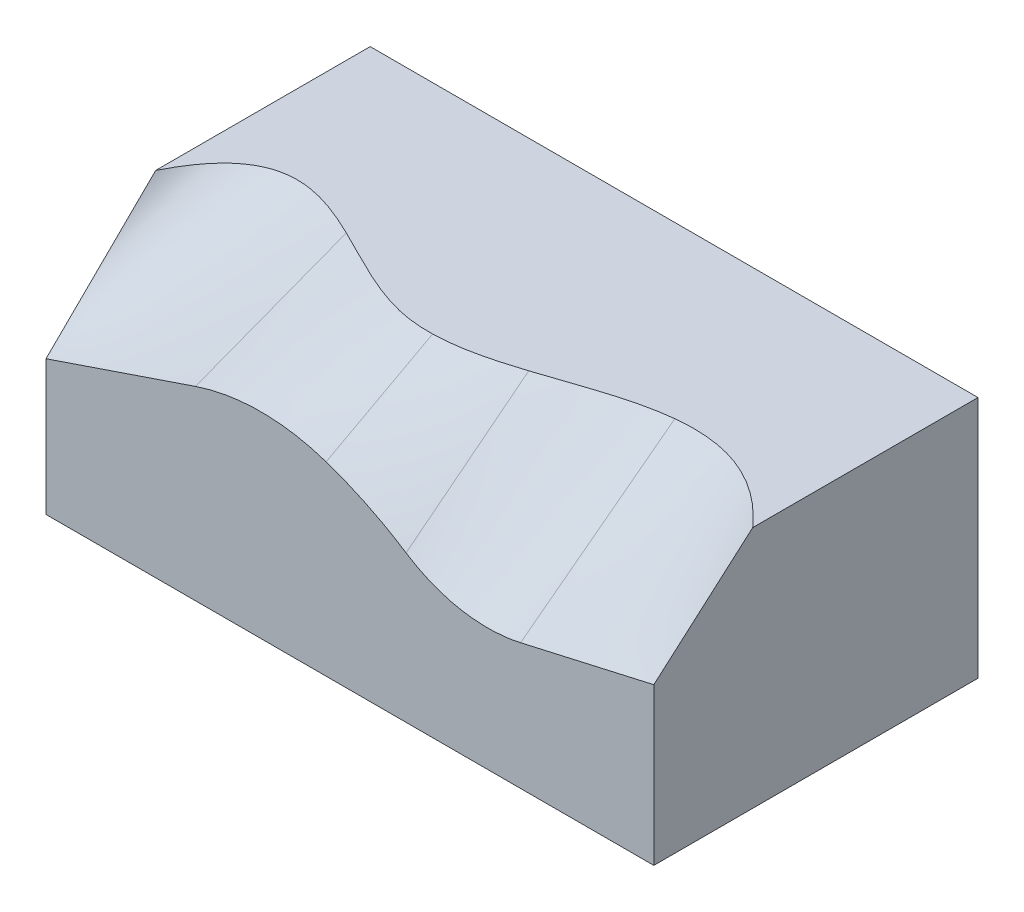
ISO-10303-21;
HEADER;
FILE_DESCRIPTION(('STEP AP214'),'2;1');
FILE_NAME('part.step','',(''),(''),'','','');
FILE_SCHEMA(('AUTOMOTIVE_DESIGN { 1 0 10303 214 1 1 1 1 }'));
ENDSEC;
DATA;
#1=APPLICATION_CONTEXT('core data for automotive mechanical design processes');
#2=APPLICATION_PROTOCOL_DEFINITION('international standard','automotive_design',2000,#1);
#3=PRODUCT_CONTEXT('',#1,'mechanical');
#4=PRODUCT('Part','Part','',(#3));
#5=PRODUCT_RELATED_PRODUCT_CATEGORY('part','',(#4));
#6=PRODUCT_DEFINITION_FORMATION('','',#4);
#7=PRODUCT_DEFINITION_CONTEXT('part definition',#1,'design');
#8=PRODUCT_DEFINITION('design','',#6,#7);
#9=PRODUCT_DEFINITION_SHAPE('','',#8);
#10=(LENGTH_UNIT() NAMED_UNIT(*) SI_UNIT(.MILLI.,.METRE.));
#11=(NAMED_UNIT(*) PLANE_ANGLE_UNIT() SI_UNIT($,.RADIAN.));
#12=(NAMED_UNIT(*) SI_UNIT($,.STERADIAN.) SOLID_ANGLE_UNIT());
#13=UNCERTAINTY_MEASURE_WITH_UNIT(LENGTH_MEASURE(1.E-05),#10,'distance_accuracy_value','');
#14=(GEOMETRIC_REPRESENTATION_CONTEXT(3) GLOBAL_UNCERTAINTY_ASSIGNED_CONTEXT((#13)) GLOBAL_UNIT_ASSIGNED_CONTEXT((#10,
#11,#12)) REPRESENTATION_CONTEXT('',''));
#15=CARTESIAN_POINT('',(0.,0.,0.));
#16=DIRECTION('',(0.,0.,1.));
#17=DIRECTION('',(1.,0.,0.));
#18=AXIS2_PLACEMENT_3D('',#15,#16,#17);
#19=CARTESIAN_POINT('',(-19.0602464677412,30.,1.3836037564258));
#20=CARTESIAN_POINT('',(-16.4696594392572,30.,2.64271465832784));
#21=CARTESIAN_POINT('',(-13.7329373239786,30.,4.15108141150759));
#22=CARTESIAN_POINT('',(-9.62797534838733,30.,5.80249540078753));
#23=CARTESIAN_POINT('',(-8.25967105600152,30.,6.25008801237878));
#24=CARTESIAN_POINT('',(-5.55963746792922,30.,6.80012059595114));
#25=CARTESIAN_POINT('',(-4.22793474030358,30.,6.89509799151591));
#26=CARTESIAN_POINT('',(-2.93234560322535,30.,6.86566078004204));
#27=CARTESIAN_POINT('',(-19.0602464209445,22.9093358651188,20.));
#28=CARTESIAN_POINT('',(-16.468830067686,23.789720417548,20.));
#29=CARTESIAN_POINT('',(-13.7329373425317,24.241727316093,20.));
#30=CARTESIAN_POINT('',(-9.62797534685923,24.241727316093,20.));
#31=CARTESIAN_POINT('',(-8.25967105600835,24.1294472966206,20.));
#32=CARTESIAN_POINT('',(-5.55963746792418,23.6833257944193,20.));
#33=CARTESIAN_POINT('',(-4.22794759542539,23.3494920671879,20.));
#34=CARTESIAN_POINT('',(-2.93234560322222,22.9093358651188,20.));
#35=B_SPLINE_SURFACE_WITH_KNOTS('',1,3,((#19,#20,#21,#22,#23,#24,#25,#26),(#27,#28,#29,#30,#31,
#32,#33,#34)),.UNSPECIFIED.,.F.,.F.,.F.,(2,2),(4,2,2,4),(0.,1.),(1.24329893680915,
1.5707963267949,1.73454502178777,1.89829371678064),.UNSPECIFIED.);
#36=CARTESIAN_POINT('',(-19.0602464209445,22.9093358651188,20.));
#37=CARTESIAN_POINT('',(-19.0602464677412,30.,1.3836037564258));
#38=B_SPLINE_CURVE_WITH_KNOTS('',1,(#36,#37),.UNSPECIFIED.,.F.,.F.,(2,2),(0.,1.),.UNSPECIFIED.);
#39=CARTESIAN_POINT('',(-19.0602464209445,22.9093358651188,20.));
#40=VERTEX_POINT('',#39);
#41=CARTESIAN_POINT('',(-19.0602464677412,30.,1.3836037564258));
#42=VERTEX_POINT('',#41);
#43=EDGE_CURVE('E11',#40,#42,#38,.T.);
#44=CARTESIAN_POINT('',(-19.0602464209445,22.9093358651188,20.));
#45=CARTESIAN_POINT('',(-16.468830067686,23.789720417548,20.));
#46=CARTESIAN_POINT('',(-13.7329373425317,24.241727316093,20.));
#47=CARTESIAN_POINT('',(-9.62797534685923,24.241727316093,20.));
#48=CARTESIAN_POINT('',(-8.25967105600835,24.1294472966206,20.));
#49=CARTESIAN_POINT('',(-5.55963746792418,23.6833257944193,20.));
#50=CARTESIAN_POINT('',(-4.22794759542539,23.3494920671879,20.));
#51=CARTESIAN_POINT('',(-2.93234560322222,22.9093358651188,20.));
#52=B_SPLINE_CURVE_WITH_KNOTS('',3,(#44,#45,#46,#47,#48,#49,#50,#51),.UNSPECIFIED.,.F.,.F.,(4,2,
2,4),(1.24329893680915,1.5707963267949,1.73454502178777,1.89829371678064),.UNSPECIFIED.);
#53=CARTESIAN_POINT('',(-2.93234560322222,22.9093358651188,20.));
#54=VERTEX_POINT('',#53);
#55=EDGE_CURVE('E124',#40,#54,#52,.T.);
#56=CARTESIAN_POINT('',(-2.93234560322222,22.9093358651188,20.));
#57=CARTESIAN_POINT('',(-2.93234560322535,30.,6.86566078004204));
#58=B_SPLINE_CURVE_WITH_KNOTS('',1,(#56,#57),.UNSPECIFIED.,.F.,.F.,(2,2),(0.,1.),.UNSPECIFIED.);
#59=CARTESIAN_POINT('',(-2.93234560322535,30.,6.86566078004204));
#60=VERTEX_POINT('',#59);
#61=EDGE_CURVE('E48',#54,#60,#58,.T.);
#62=CARTESIAN_POINT('',(-2.93234560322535,30.,6.86566078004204));
#63=CARTESIAN_POINT('',(-4.22793474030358,30.,6.89509799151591));
#64=CARTESIAN_POINT('',(-5.55963746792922,30.,6.80012059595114));
#65=CARTESIAN_POINT('',(-8.25967105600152,30.,6.25008801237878));
#66=CARTESIAN_POINT('',(-9.62797534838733,30.,5.80249540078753));
#67=CARTESIAN_POINT('',(-13.7329373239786,30.,4.15108141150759));
#68=CARTESIAN_POINT('',(-16.4696594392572,30.,2.64271465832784));
#69=CARTESIAN_POINT('',(-19.0602464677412,30.,1.3836037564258));
#70=B_SPLINE_CURVE_WITH_KNOTS('',3,(#62,#63,#64,#65,#66,#67,#68,#69),.UNSPECIFIED.,.F.,.F.,(4,2,
2,4),(1.24329893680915,1.40704763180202,1.5707963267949,1.89829371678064),.UNSPECIFIED.);
#71=EDGE_CURVE('E120',#42,#60,#70,.F.);
#72=ORIENTED_EDGE('',*,*,#43,.F.);
#73=ORIENTED_EDGE('',*,*,#55,.T.);
#74=ORIENTED_EDGE('',*,*,#61,.T.);
#75=ORIENTED_EDGE('',*,*,#71,.F.);
#76=EDGE_LOOP('',(#72,#73,#74,#75));
#77=FACE_BOUND('',#76,.T.);
#78=ADVANCED_FACE('F34',(#77),#35,.T.);
#79=CARTESIAN_POINT('',(-2.93234560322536,30.,6.86566078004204));
#80=CARTESIAN_POINT('',(-1.19683927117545,30.,6.82622816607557));
#81=CARTESIAN_POINT('',(0.501611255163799,30.,6.5664786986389));
#82=CARTESIAN_POINT('',(3.79800894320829,30.,5.83137113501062));
#83=CARTESIAN_POINT('',(5.39617921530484,30.,5.35647146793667));
#84=CARTESIAN_POINT('',(6.93099869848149,30.,4.86386269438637));
#85=CARTESIAN_POINT('',(-2.93234560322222,22.9093358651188,20.));
#86=CARTESIAN_POINT('',(-1.1968699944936,22.3197409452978,20.));
#87=CARTESIAN_POINT('',(0.501611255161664,21.6212977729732,20.));
#88=CARTESIAN_POINT('',(3.79800894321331,20.0176448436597,20.));
#89=CARTESIAN_POINT('',(5.39590570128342,19.1124446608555,20.));
#90=CARTESIAN_POINT('',(6.93099869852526,18.1109521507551,20.));
#91=B_SPLINE_SURFACE_WITH_KNOTS('',1,3,((#79,#80,#81,#82,#83,#84),(#85,#86,#87,#88,#89,#90)),
.UNSPECIFIED.,.F.,.F.,.F.,(2,2),(4,2,4),(0.,1.),(1.89829371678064,2.02357479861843,
2.14885588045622),.UNSPECIFIED.);
#92=CARTESIAN_POINT('',(-2.93234560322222,22.9093358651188,20.));
#93=CARTESIAN_POINT('',(-1.1968699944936,22.3197409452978,20.));
#94=CARTESIAN_POINT('',(0.501611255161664,21.6212977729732,20.));
#95=CARTESIAN_POINT('',(3.79800894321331,20.0176448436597,20.));
#96=CARTESIAN_POINT('',(5.39590570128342,19.1124446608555,20.));
#97=CARTESIAN_POINT('',(6.93099869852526,18.1109521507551,20.));
#98=B_SPLINE_CURVE_WITH_KNOTS('',3,(#92,#93,#94,#95,#96,#97),.UNSPECIFIED.,.F.,.F.,(4,2,4),
(1.89829371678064,2.02357479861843,2.14885588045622),.UNSPECIFIED.);
#99=CARTESIAN_POINT('',(6.93099869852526,18.1109521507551,20.));
#100=VERTEX_POINT('',#99);
#101=EDGE_CURVE('E445',#54,#100,#98,.T.);
#102=CARTESIAN_POINT('',(6.93099869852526,18.1109521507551,20.));
#103=CARTESIAN_POINT('',(6.93099869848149,30.,4.86386269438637));
#104=B_SPLINE_CURVE_WITH_KNOTS('',1,(#102,#103),.UNSPECIFIED.,.F.,.F.,(2,2),(0.,1.),.UNSPECIFIED.);
#105=CARTESIAN_POINT('',(6.93099869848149,30.,4.86386269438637));
#106=VERTEX_POINT('',#105);
#107=EDGE_CURVE('E130',#100,#106,#104,.T.);
#108=CARTESIAN_POINT('',(6.93099869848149,30.,4.86386269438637));
#109=CARTESIAN_POINT('',(5.39617921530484,30.,5.35647146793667));
#110=CARTESIAN_POINT('',(3.79800894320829,30.,5.83137113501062));
#111=CARTESIAN_POINT('',(0.501611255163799,30.,6.5664786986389));
#112=CARTESIAN_POINT('',(-1.19683927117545,30.,6.82622816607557));
#113=CARTESIAN_POINT('',(-2.93234560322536,30.,6.86566078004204));
#114=B_SPLINE_CURVE_WITH_KNOTS('',3,(#108,#109,#110,#111,#112,#113),.UNSPECIFIED.,.F.,.F.,(4,2,
4),(1.89829371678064,2.02357479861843,2.14885588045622),.UNSPECIFIED.);
#115=EDGE_CURVE('E134',#60,#106,#114,.F.);
#116=ORIENTED_EDGE('',*,*,#61,.F.);
#117=ORIENTED_EDGE('',*,*,#101,.T.);
#118=ORIENTED_EDGE('',*,*,#107,.T.);
#119=ORIENTED_EDGE('',*,*,#115,.F.);
#120=EDGE_LOOP('',(#116,#117,#118,#119));
#121=FACE_BOUND('',#120,.T.);
#122=ADVANCED_FACE('F136',(#121),#91,.T.);
#123=CARTESIAN_POINT('',(21.059572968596,15.5784718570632,20.));
#124=CARTESIAN_POINT('',(19.8613116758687,15.3063170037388,20.));
#125=CARTESIAN_POINT('',(18.6357585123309,15.1546097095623,20.));
#126=CARTESIAN_POINT('',(16.1788795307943,15.098123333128,20.));
#127=CARTESIAN_POINT('',(14.9476342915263,15.1933491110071,20.));
#128=CARTESIAN_POINT('',(12.5286583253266,15.6269391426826,20.));
#129=CARTESIAN_POINT('',(11.3409924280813,15.9652917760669,20.));
#130=CARTESIAN_POINT('',(9.05669202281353,16.8716121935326,20.));
#131=CARTESIAN_POINT('',(7.96013138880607,17.4395474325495,20.));
#132=CARTESIAN_POINT('',(6.93099869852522,18.1109521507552,20.));
#133=CARTESIAN_POINT('',(21.0595729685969,30.,0.966564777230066));
#134=CARTESIAN_POINT('',(19.8614006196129,30.,1.09239312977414));
#135=CARTESIAN_POINT('',(18.6357585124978,30.,1.31314282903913));
#136=CARTESIAN_POINT('',(16.1788795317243,30.,1.88604165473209));
#137=CARTESIAN_POINT('',(14.9476342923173,30.,2.23737287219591));
#138=CARTESIAN_POINT('',(12.5286583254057,30.,2.98979415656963));
#139=CARTESIAN_POINT('',(11.3409924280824,30.,3.39007647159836));
#140=CARTESIAN_POINT('',(9.05669202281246,30.,4.16222626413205));
#141=CARTESIAN_POINT('',(7.95991199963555,30.,4.53362729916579));
#142=CARTESIAN_POINT('',(6.93099869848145,30.,4.86386269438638));
#143=B_SPLINE_SURFACE_WITH_KNOTS('',1,3,((#123,#124,#125,#126,#127,#128,#129,#130,#131,#132),
(#133,#134,#135,#136,#137,#138,#139,#140,#141,#142)),.UNSPECIFIED.,.F.,.F.,.F.,(2,2),(4,2,2,2,
4),(0.,1.),(4.48905304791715,4.68940191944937,4.88975079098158,5.0900996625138,
5.29044853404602),.UNSPECIFIED.);
#144=CARTESIAN_POINT('',(6.93099869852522,18.1109521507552,20.));
#145=CARTESIAN_POINT('',(7.96013138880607,17.4395474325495,20.));
#146=CARTESIAN_POINT('',(9.05669202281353,16.8716121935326,20.));
#147=CARTESIAN_POINT('',(11.3409924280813,15.9652917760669,20.));
#148=CARTESIAN_POINT('',(12.5286583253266,15.6269391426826,20.));
#149=CARTESIAN_POINT('',(14.9476342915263,15.1933491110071,20.));
#150=CARTESIAN_POINT('',(16.1788795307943,15.098123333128,20.));
#151=CARTESIAN_POINT('',(18.6357585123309,15.1546097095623,20.));
#152=CARTESIAN_POINT('',(19.8613116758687,15.3063170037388,20.));
#153=CARTESIAN_POINT('',(21.059572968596,15.5784718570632,20.));
#154=B_SPLINE_CURVE_WITH_KNOTS('',3,(#144,#145,#146,#147,#148,#149,#150,#151,#152,#153),
.UNSPECIFIED.,.F.,.F.,(4,2,2,2,4),(4.48905304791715,4.68940191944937,4.88975079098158,
5.0900996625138,5.29044853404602),.UNSPECIFIED.);
#155=CARTESIAN_POINT('',(21.059572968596,15.5784718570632,20.));
#156=VERTEX_POINT('',#155);
#157=EDGE_CURVE('E441',#100,#156,#154,.T.);
#158=CARTESIAN_POINT('',(21.059572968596,15.5784718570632,20.));
#159=CARTESIAN_POINT('',(21.0595729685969,30.,0.966564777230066));
#160=B_SPLINE_CURVE_WITH_KNOTS('',1,(#158,#159),.UNSPECIFIED.,.F.,.F.,(2,2),(0.,1.),.UNSPECIFIED.);
#161=CARTESIAN_POINT('',(21.0595729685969,30.,0.966564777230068));
#162=VERTEX_POINT('',#161);
#163=EDGE_CURVE('E56',#156,#162,#160,.T.);
#164=CARTESIAN_POINT('',(21.0595729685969,30.,0.966564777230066));
#165=CARTESIAN_POINT('',(19.8614006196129,30.,1.09239312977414));
#166=CARTESIAN_POINT('',(18.6357585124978,30.,1.31314282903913));
#167=CARTESIAN_POINT('',(16.1788795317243,30.,1.88604165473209));
#168=CARTESIAN_POINT('',(14.9476342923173,30.,2.23737287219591));
#169=CARTESIAN_POINT('',(12.5286583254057,30.,2.98979415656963));
#170=CARTESIAN_POINT('',(11.3409924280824,30.,3.39007647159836));
#171=CARTESIAN_POINT('',(9.05669202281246,30.,4.16222626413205));
#172=CARTESIAN_POINT('',(7.95991199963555,30.,4.53362729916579));
#173=CARTESIAN_POINT('',(6.93099869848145,30.,4.86386269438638));
#174=B_SPLINE_CURVE_WITH_KNOTS('',3,(#164,#165,#166,#167,#168,#169,#170,#171,#172,#173),
.UNSPECIFIED.,.F.,.F.,(4,2,2,2,4),(4.48905304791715,4.68940191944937,4.88975079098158,
5.0900996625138,5.29044853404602),.UNSPECIFIED.);
#175=EDGE_CURVE('E141',#106,#162,#174,.F.);
#176=ORIENTED_EDGE('',*,*,#107,.F.);
#177=ORIENTED_EDGE('',*,*,#157,.T.);
#178=ORIENTED_EDGE('',*,*,#163,.T.);
#179=ORIENTED_EDGE('',*,*,#175,.F.);
#180=EDGE_LOOP('',(#176,#177,#178,#179));
#181=FACE_BOUND('',#180,.T.);
#182=ADVANCED_FACE('F252',(#181),#143,.T.);
#183=CARTESIAN_POINT('',(21.0595729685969,30.,0.966564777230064));
#184=CARTESIAN_POINT('',(24.0735901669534,30.,0.650042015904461));
#185=CARTESIAN_POINT('',(27.0877297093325,30.,0.904988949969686));
#186=CARTESIAN_POINT('',(31.608846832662,30.,2.86271309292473));
#187=CARTESIAN_POINT('',(33.1158860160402,30.,3.77810861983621));
#188=CARTESIAN_POINT('',(35.3764448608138,30.,5.6385165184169));
#189=CARTESIAN_POINT('',(36.1299488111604,30.,6.33988320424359));
#190=CARTESIAN_POINT('',(37.0718644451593,30.,7.32811704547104));
#191=CARTESIAN_POINT('',(37.2602437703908,30.,7.53133503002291));
#192=CARTESIAN_POINT('',(37.6370035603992,30.,7.94917328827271));
#193=CARTESIAN_POINT('',(37.8253834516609,30.,8.16002592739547));
#194=CARTESIAN_POINT('',(38.3905231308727,30.,8.78989587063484));
#195=CARTESIAN_POINT('',(38.7672829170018,30.,9.20980916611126));
#196=CARTESIAN_POINT('',(39.1440427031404,30.,9.6297224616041));
#197=CARTESIAN_POINT('',(21.059572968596,15.5784718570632,20.));
#198=CARTESIAN_POINT('',(24.0736512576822,16.2630437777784,20.));
#199=CARTESIAN_POINT('',(27.0877295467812,16.9476156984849,20.));
#200=CARTESIAN_POINT('',(31.6088469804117,17.9744735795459,20.));
#201=CARTESIAN_POINT('',(33.1158861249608,18.3167595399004,20.));
#202=CARTESIAN_POINT('',(35.376444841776,18.8301884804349,20.));
#203=CARTESIAN_POINT('',(36.1299644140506,19.0013314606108,20.));
#204=CARTESIAN_POINT('',(37.0718638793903,19.2152601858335,20.));
#205=CARTESIAN_POINT('',(37.260243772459,19.2580459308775,20.));
#206=CARTESIAN_POINT('',(37.6370035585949,19.3436174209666,20.));
#207=CARTESIAN_POINT('',(37.8253834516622,19.3864031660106,20.));
#208=CARTESIAN_POINT('',(38.39052313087,19.5147604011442,20.));
#209=CARTESIAN_POINT('',(38.7672829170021,19.6003318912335,20.));
#210=CARTESIAN_POINT('',(39.1440427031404,19.6859033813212,20.));
#211=B_SPLINE_SURFACE_WITH_KNOTS('',1,3,((#183,#184,#185,#186,#187,#188,#189,#190,#191,#192,
#193,#194,#195,#196),(#197,#198,#199,#200,#201,#202,#203,#204,#205,#206,#207,#208,#209,#210)),
.UNSPECIFIED.,.F.,.F.,.F.,(2,2),(4,2,2,2,2,2,4),(0.,1.),(0.0539110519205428,0.063183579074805,
0.0678198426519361,0.0701379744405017,0.0707175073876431,0.0712970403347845,0.0724561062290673),.UNSPECIFIED.);
#212=CARTESIAN_POINT('',(21.059572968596,15.5784718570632,20.));
#213=CARTESIAN_POINT('',(24.0736512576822,16.2630437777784,20.));
#214=CARTESIAN_POINT('',(27.0877295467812,16.9476156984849,20.));
#215=CARTESIAN_POINT('',(31.6088469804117,17.9744735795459,20.));
#216=CARTESIAN_POINT('',(33.1158861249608,18.3167595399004,20.));
#217=CARTESIAN_POINT('',(35.376444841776,18.8301884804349,20.));
#218=CARTESIAN_POINT('',(36.1299644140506,19.0013314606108,20.));
#219=CARTESIAN_POINT('',(37.0718638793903,19.2152601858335,20.));
#220=CARTESIAN_POINT('',(37.260243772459,19.2580459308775,20.));
#221=CARTESIAN_POINT('',(37.6370035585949,19.3436174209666,20.));
#222=CARTESIAN_POINT('',(37.8253834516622,19.3864031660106,20.));
#223=CARTESIAN_POINT('',(38.39052313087,19.5147604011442,20.));
#224=CARTESIAN_POINT('',(38.7672829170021,19.6003318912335,20.));
#225=CARTESIAN_POINT('',(39.1440427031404,19.6859033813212,20.));
#226=B_SPLINE_CURVE_WITH_KNOTS('',3,(#212,#213,#214,#215,#216,#217,#218,#219,#220,#221,#222,
#223,#224,#225),.UNSPECIFIED.,.F.,.F.,(4,2,2,2,2,2,4),(0.0539110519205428,0.063183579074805,
0.0678198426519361,0.0701379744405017,0.0707175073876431,0.0712970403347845,0.0724561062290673),.UNSPECIFIED.);
#227=CARTESIAN_POINT('',(37.5,19.3125005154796,20.));
#228=VERTEX_POINT('',#227);
#229=EDGE_CURVE('E235',#156,#228,#226,.T.);
#230=CARTESIAN_POINT('',(37.5,19.3125005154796,20.));
#231=CARTESIAN_POINT('',(37.5,19.7578110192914,19.4915555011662));
#232=CARTESIAN_POINT('',(37.5,20.2031215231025,18.9831110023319));
#233=CARTESIAN_POINT('',(37.5,21.0937425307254,17.9662220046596));
#234=CARTESIAN_POINT('',(37.5,21.5390530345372,17.4577775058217));
#235=CARTESIAN_POINT('',(37.5,22.4296740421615,16.4408885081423));
#236=CARTESIAN_POINT('',(37.5,22.874984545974,15.9324440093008));
#237=CARTESIAN_POINT('',(37.5,23.7656055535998,14.9155550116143));
#238=CARTESIAN_POINT('',(37.5,24.2109160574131,14.4071105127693));
#239=CARTESIAN_POINT('',(37.5,25.1015370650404,13.3902215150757));
#240=CARTESIAN_POINT('',(37.5,25.5468475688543,12.8817770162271));
#241=CARTESIAN_POINT('',(37.5,26.4374685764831,11.8648880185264));
#242=CARTESIAN_POINT('',(37.5,26.8827790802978,11.3564435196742));
#243=CARTESIAN_POINT('',(37.5,27.7734000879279,10.3395545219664));
#244=CARTESIAN_POINT('',(37.5,28.2187105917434,9.83111002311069));
#245=CARTESIAN_POINT('',(37.5,29.109331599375,8.81422102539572));
#246=CARTESIAN_POINT('',(37.5,29.5546421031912,8.30577652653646));
#247=CARTESIAN_POINT('',(37.5,29.9999526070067,7.79733202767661));
#248=B_SPLINE_CURVE_WITH_KNOTS('',3,(#230,#231,#232,#233,#234,#235,#236,#237,#238,#239,#240,
#241,#242,#243,#244,#245,#246,#247),.UNSPECIFIED.,.F.,.F.,(4,2,2,2,2,2,2,2,4),(0.,
2.02764772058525,4.05529544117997,6.08294316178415,8.1105908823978,10.1382386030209,
12.1658863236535,14.1935340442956,16.2211817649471),.UNSPECIFIED.);
#249=CARTESIAN_POINT('',(37.5,29.9999526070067,7.79733202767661));
#250=VERTEX_POINT('',#249);
#251=EDGE_CURVE('E69',#250,#228,#248,.F.);
#252=CARTESIAN_POINT('',(39.1440427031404,30.,9.6297224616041));
#253=CARTESIAN_POINT('',(38.7672829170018,30.,9.20980916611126));
#254=CARTESIAN_POINT('',(38.3905231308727,30.,8.78989587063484));
#255=CARTESIAN_POINT('',(37.8253834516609,30.,8.16002592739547));
#256=CARTESIAN_POINT('',(37.6370035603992,30.,7.94917328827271));
#257=CARTESIAN_POINT('',(37.2602437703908,30.,7.53133503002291));
#258=CARTESIAN_POINT('',(37.0718644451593,30.,7.32811704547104));
#259=CARTESIAN_POINT('',(36.1299488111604,30.,6.33988320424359));
#260=CARTESIAN_POINT('',(35.3764448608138,30.,5.6385165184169));
#261=CARTESIAN_POINT('',(33.1158860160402,30.,3.77810861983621));
#262=CARTESIAN_POINT('',(31.608846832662,30.,2.86271309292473));
#263=CARTESIAN_POINT('',(27.0877297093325,30.,0.904988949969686));
#264=CARTESIAN_POINT('',(24.0735901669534,30.,0.650042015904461));
#265=CARTESIAN_POINT('',(21.0595729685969,30.,0.966564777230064));
#266=B_SPLINE_CURVE_WITH_KNOTS('',3,(#252,#253,#254,#255,#256,#257,#258,#259,#260,#261,#262,
#263,#264,#265),.UNSPECIFIED.,.F.,.F.,(4,2,2,2,2,2,4),(0.0539110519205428,0.0550701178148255,
0.0556496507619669,0.0562291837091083,0.0585473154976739,0.063183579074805,0.0724561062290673),.UNSPECIFIED.);
#267=EDGE_CURVE('E279',#162,#250,#266,.F.);
#268=ORIENTED_EDGE('',*,*,#163,.F.);
#269=ORIENTED_EDGE('',*,*,#229,.T.);
#270=ORIENTED_EDGE('',*,*,#251,.F.);
#271=ORIENTED_EDGE('',*,*,#267,.F.);
#272=EDGE_LOOP('',(#268,#269,#270,#271));
#273=FACE_BOUND('',#272,.T.);
#274=ADVANCED_FACE('F241',(#273),#211,.T.);
#275=CARTESIAN_POINT('',(-39.3439753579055,30.,10.1358317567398));
#276=CARTESIAN_POINT('',(-38.9213976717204,30.,9.29448241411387));
#277=CARTESIAN_POINT('',(-38.4988199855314,30.,8.4531330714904));
#278=CARTESIAN_POINT('',(-37.970597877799,30.,7.40144639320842));
#279=CARTESIAN_POINT('',(-37.8649534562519,30.,7.19110905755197));
#280=CARTESIAN_POINT('',(-37.653664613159,30.,6.77043438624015));
#281=CARTESIAN_POINT('',(-37.5480202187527,30.,6.5584969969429));
#282=CARTESIAN_POINT('',(-37.231086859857,30.,5.93408866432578));
#283=CARTESIAN_POINT('',(-37.0197980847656,30.,5.54190994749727));
#284=CARTESIAN_POINT('',(-35.963353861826,30.,3.69115267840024));
#285=CARTESIAN_POINT('',(-35.1181984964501,30.,2.5595499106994));
#286=CARTESIAN_POINT('',(-33.4278877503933,30.,0.79320988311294));
#287=CARTESIAN_POINT('',(-32.5827323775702,30.,0.15969015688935));
#288=CARTESIAN_POINT('',(-30.8924216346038,30.,-0.744921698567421));
#289=CARTESIAN_POINT('',(-30.0472651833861,30.,-1.0153926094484));
#290=CARTESIAN_POINT('',(-28.356956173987,30.,-1.2919127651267));
#291=CARTESIAN_POINT('',(-27.5118131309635,30.,-1.29761665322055));
#292=CARTESIAN_POINT('',(-25.8214779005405,30.,-1.11968353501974));
#293=CARTESIAN_POINT('',(-24.9763345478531,30.,-0.935843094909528));
#294=CARTESIAN_POINT('',(-22.4408696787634,30.,-0.190408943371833));
#295=CARTESIAN_POINT('',(-20.7498777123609,30.,0.562387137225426));
#296=CARTESIAN_POINT('',(-19.0602464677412,30.,1.3836037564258));
#297=CARTESIAN_POINT('',(-39.3439753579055,16.0183236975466,20.));
#298=CARTESIAN_POINT('',(-38.9213976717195,16.1618864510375,20.));
#299=CARTESIAN_POINT('',(-38.4988199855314,16.305449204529,20.));
#300=CARTESIAN_POINT('',(-37.970597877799,16.4849026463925,20.));
#301=CARTESIAN_POINT('',(-37.8649534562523,16.5207933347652,20.));
#302=CARTESIAN_POINT('',(-37.6536646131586,16.592574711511,20.));
#303=CARTESIAN_POINT('',(-37.5480201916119,16.6284653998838,20.));
#304=CARTESIAN_POINT('',(-37.2310869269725,16.7361374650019,20.));
#305=CARTESIAN_POINT('',(-37.0197980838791,16.8079188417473,20.));
#306=CARTESIAN_POINT('',(-35.9633538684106,17.1668257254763,20.));
#307=CARTESIAN_POINT('',(-35.1181984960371,17.4539512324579,20.));
#308=CARTESIAN_POINT('',(-33.4278877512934,18.0282022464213,20.));
#309=CARTESIAN_POINT('',(-32.5827323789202,18.3153277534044,20.));
#310=CARTESIAN_POINT('',(-30.8924216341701,18.8895787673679,20.));
#311=CARTESIAN_POINT('',(-30.0472662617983,19.176704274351,20.));
#312=CARTESIAN_POINT('',(-28.3569555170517,19.7509552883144,20.));
#313=CARTESIAN_POINT('',(-27.5118001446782,20.038080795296,20.));
#314=CARTESIAN_POINT('',(-25.8214893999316,20.6123318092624,20.));
#315=CARTESIAN_POINT('',(-24.9763340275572,20.8994573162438,20.));
#316=CARTESIAN_POINT('',(-22.4408679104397,21.7608338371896,20.));
#317=CARTESIAN_POINT('',(-20.7505571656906,22.3350848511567,20.));
#318=CARTESIAN_POINT('',(-19.0602464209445,22.9093358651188,20.));
#319=B_SPLINE_SURFACE_WITH_KNOTS('',1,3,((#275,#276,#277,#278,#279,#280,#281,#282,#283,#284,
#285,#286,#287,#288,#289,#290,#291,#292,#293,#294,#295,#296),(#297,#298,#299,#300,#301,#302,
#303,#304,#305,#306,#307,#308,#309,#310,#311,#312,#313,#314,#315,#316,#317,#318)),.UNSPECIFIED.,
.F.,.F.,.F.,(2,2),(4,2,2,2,2,2,2,2,2,2,4),(0.,1.),(-0.00624351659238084,-0.0049046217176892,
-0.00456989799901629,-0.00423517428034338,-0.00356572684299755,-0.000887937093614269,
0.00178985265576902,0.0044676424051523,0.00714543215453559,0.00982322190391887,
0.0151788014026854),.UNSPECIFIED.);
#320=CARTESIAN_POINT('',(-39.3439753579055,16.0183236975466,20.));
#321=CARTESIAN_POINT('',(-38.9213976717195,16.1618864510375,20.));
#322=CARTESIAN_POINT('',(-38.4988199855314,16.305449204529,20.));
#323=CARTESIAN_POINT('',(-37.970597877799,16.4849026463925,20.));
#324=CARTESIAN_POINT('',(-37.8649534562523,16.5207933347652,20.));
#325=CARTESIAN_POINT('',(-37.6536646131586,16.592574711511,20.));
#326=CARTESIAN_POINT('',(-37.5480201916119,16.6284653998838,20.));
#327=CARTESIAN_POINT('',(-37.2310869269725,16.7361374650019,20.));
#328=CARTESIAN_POINT('',(-37.0197980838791,16.8079188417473,20.));
#329=CARTESIAN_POINT('',(-35.9633538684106,17.1668257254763,20.));
#330=CARTESIAN_POINT('',(-35.1181984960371,17.4539512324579,20.));
#331=CARTESIAN_POINT('',(-33.4278877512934,18.0282022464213,20.));
#332=CARTESIAN_POINT('',(-32.5827323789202,18.3153277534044,20.));
#333=CARTESIAN_POINT('',(-30.8924216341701,18.8895787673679,20.));
#334=CARTESIAN_POINT('',(-30.0472662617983,19.176704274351,20.));
#335=CARTESIAN_POINT('',(-28.3569555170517,19.7509552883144,20.));
#336=CARTESIAN_POINT('',(-27.5118001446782,20.038080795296,20.));
#337=CARTESIAN_POINT('',(-25.8214893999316,20.6123318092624,20.));
#338=CARTESIAN_POINT('',(-24.9763340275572,20.8994573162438,20.));
#339=CARTESIAN_POINT('',(-22.4408679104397,21.7608338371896,20.));
#340=CARTESIAN_POINT('',(-20.7505571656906,22.3350848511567,20.));
#341=CARTESIAN_POINT('',(-19.0602464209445,22.9093358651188,20.));
#342=B_SPLINE_CURVE_WITH_KNOTS('',3,(#320,#321,#322,#323,#324,#325,#326,#327,#328,#329,#330,
#331,#332,#333,#334,#335,#336,#337,#338,#339,#340,#341),.UNSPECIFIED.,.F.,.F.,(4,2,2,2,2,2,2,2,
2,2,4),(-0.00624351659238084,-0.0049046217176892,-0.00456989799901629,-0.00423517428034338,
-0.00356572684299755,-0.000887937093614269,0.00178985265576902,0.0044676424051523,
0.00714543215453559,0.00982322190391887,0.0151788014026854),.UNSPECIFIED.);
#343=CARTESIAN_POINT('',(-37.5,16.644779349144,20.));
#344=VERTEX_POINT('',#343);
#345=EDGE_CURVE('E354',#344,#40,#342,.T.);
#346=CARTESIAN_POINT('',(-19.0602464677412,30.,1.3836037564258));
#347=CARTESIAN_POINT('',(-20.7498777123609,30.,0.562387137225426));
#348=CARTESIAN_POINT('',(-22.4408696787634,30.,-0.190408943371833));
#349=CARTESIAN_POINT('',(-24.9763345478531,30.,-0.935843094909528));
#350=CARTESIAN_POINT('',(-25.8214779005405,30.,-1.11968353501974));
#351=CARTESIAN_POINT('',(-27.5118131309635,30.,-1.29761665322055));
#352=CARTESIAN_POINT('',(-28.356956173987,30.,-1.2919127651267));
#353=CARTESIAN_POINT('',(-30.0472651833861,30.,-1.0153926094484));
#354=CARTESIAN_POINT('',(-30.8924216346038,30.,-0.744921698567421));
#355=CARTESIAN_POINT('',(-32.5827323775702,30.,0.15969015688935));
#356=CARTESIAN_POINT('',(-33.4278877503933,30.,0.79320988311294));
#357=CARTESIAN_POINT('',(-35.1181984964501,30.,2.5595499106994));
#358=CARTESIAN_POINT('',(-35.963353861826,30.,3.69115267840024));
#359=CARTESIAN_POINT('',(-37.0197980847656,30.,5.54190994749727));
#360=CARTESIAN_POINT('',(-37.231086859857,30.,5.93408866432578));
#361=CARTESIAN_POINT('',(-37.5480202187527,30.,6.5584969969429));
#362=CARTESIAN_POINT('',(-37.653664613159,30.,6.77043438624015));
#363=CARTESIAN_POINT('',(-37.8649534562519,30.,7.19110905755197));
#364=CARTESIAN_POINT('',(-37.970597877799,30.,7.40144639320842));
#365=CARTESIAN_POINT('',(-38.4988199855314,30.,8.4531330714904));
#366=CARTESIAN_POINT('',(-38.9213976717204,30.,9.29448241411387));
#367=CARTESIAN_POINT('',(-39.3439753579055,30.,10.1358317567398));
#368=B_SPLINE_CURVE_WITH_KNOTS('',3,(#346,#347,#348,#349,#350,#351,#352,#353,#354,#355,#356,
#357,#358,#359,#360,#361,#362,#363,#364,#365,#366,#367),.UNSPECIFIED.,.F.,.F.,(4,2,2,2,2,2,2,2,
2,2,4),(-0.00624351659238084,-0.000887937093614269,0.00178985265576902,0.0044676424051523,
0.00714543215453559,0.00982322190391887,0.0125010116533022,0.013170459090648,0.0135051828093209,
0.0138399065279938,0.0151788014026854),.UNSPECIFIED.);
#369=CARTESIAN_POINT('',(-37.5,29.9998725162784,6.46436338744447));
#370=VERTEX_POINT('',#369);
#371=EDGE_CURVE('E147',#370,#42,#368,.F.);
#372=CARTESIAN_POINT('',(-37.5,29.9998725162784,6.46436338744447));
#373=CARTESIAN_POINT('',(-37.5,29.4434103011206,7.02834824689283));
#374=CARTESIAN_POINT('',(-37.5,28.8869480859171,7.59233310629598));
#375=CARTESIAN_POINT('',(-37.5,27.7740236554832,8.72030282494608));
#376=CARTESIAN_POINT('',(-37.5,27.2175614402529,9.28428768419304));
#377=CARTESIAN_POINT('',(-37.5,26.1046370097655,10.4122574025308));
#378=CARTESIAN_POINT('',(-37.5,25.5481747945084,10.9762422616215));
#379=CARTESIAN_POINT('',(-37.5,24.4352503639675,12.1042119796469));
#380=CARTESIAN_POINT('',(-37.5,23.8787881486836,12.6681968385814));
#381=CARTESIAN_POINT('',(-37.5,22.7658637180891,13.7961665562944));
#382=CARTESIAN_POINT('',(-37.5,22.2094015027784,14.3601514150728));
#383=CARTESIAN_POINT('',(-37.5,21.0964770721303,15.4881211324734));
#384=CARTESIAN_POINT('',(-37.5,20.5400148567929,16.0521059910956));
#385=CARTESIAN_POINT('',(-37.5,19.4270904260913,17.1800757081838));
#386=CARTESIAN_POINT('',(-37.5,18.870628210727,17.7440605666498));
#387=CARTESIAN_POINT('',(-37.5,17.7577037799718,18.8720302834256));
#388=CARTESIAN_POINT('',(-37.5,17.2012415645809,19.4360151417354));
#389=CARTESIAN_POINT('',(-37.5,16.644779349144,20.));
#390=B_SPLINE_CURVE_WITH_KNOTS('',3,(#372,#373,#374,#375,#376,#377,#378,#379,#380,#381,#382,
#383,#384,#385,#386,#387,#388,#389),.UNSPECIFIED.,.F.,.F.,(4,2,2,2,2,2,2,2,4),(0.,
2.37688074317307,4.75376148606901,7.13064222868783,9.50752297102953,11.8844037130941,
14.2612844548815,16.6381651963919,19.0150459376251),.UNSPECIFIED.);
#391=EDGE_CURVE('E316',#344,#370,#390,.F.);
#392=ORIENTED_EDGE('',*,*,#345,.T.);
#393=ORIENTED_EDGE('',*,*,#43,.T.);
#394=ORIENTED_EDGE('',*,*,#371,.F.);
#395=ORIENTED_EDGE('',*,*,#391,.F.);
#396=EDGE_LOOP('',(#392,#393,#394,#395));
#397=FACE_BOUND('',#396,.T.);
#398=ADVANCED_FACE('F36',(#397),#319,.T.);
#399=CARTESIAN_POINT('',(-37.5,30.,20.));
#400=DIRECTION('',(0.,0.,-1.));
#401=DIRECTION('',(-1.,0.,0.));
#402=AXIS2_PLACEMENT_3D('',#399,#400,#401);
#403=PLANE('',#402);
#404=ORIENTED_EDGE('',*,*,#345,.F.);
#405=DIRECTION('',(0.,-1.,0.));
#406=VECTOR('',#405,1.);
#407=CARTESIAN_POINT('',(-37.5,30.,20.));
#408=LINE('',#407,#406);
#409=CARTESIAN_POINT('',(-37.5,0.,20.));
#410=VERTEX_POINT('',#409);
#411=EDGE_CURVE('E321',#344,#410,#408,.T.);
#412=ORIENTED_EDGE('',*,*,#411,.T.);
#413=DIRECTION('',(1.,0.,0.));
#414=VECTOR('',#413,1.);
#415=CARTESIAN_POINT('',(-37.5,0.,20.));
#416=LINE('',#415,#414);
#417=CARTESIAN_POINT('',(37.5,0.,20.));
#418=VERTEX_POINT('',#417);
#419=EDGE_CURVE('E290',#410,#418,#416,.T.);
#420=ORIENTED_EDGE('',*,*,#419,.T.);
#421=DIRECTION('',(0.,-1.,0.));
#422=VECTOR('',#421,1.);
#423=CARTESIAN_POINT('',(37.5,30.,20.));
#424=LINE('',#423,#422);
#425=EDGE_CURVE('E310',#228,#418,#424,.T.);
#426=ORIENTED_EDGE('',*,*,#425,.F.);
#427=ORIENTED_EDGE('',*,*,#229,.F.);
#428=ORIENTED_EDGE('',*,*,#157,.F.);
#429=ORIENTED_EDGE('',*,*,#101,.F.);
#430=ORIENTED_EDGE('',*,*,#55,.F.);
#431=EDGE_LOOP('',(#404,#412,#420,#426,#427,#428,#429,#430));
#432=FACE_BOUND('',#431,.T.);
#433=ADVANCED_FACE('F332',(#432),#403,.F.);
#434=CARTESIAN_POINT('',(37.5,30.,20.));
#435=DIRECTION('',(-1.,0.,0.));
#436=DIRECTION('',(0.,0.,1.));
#437=AXIS2_PLACEMENT_3D('',#434,#435,#436);
#438=PLANE('',#437);
#439=DIRECTION('',(0.,0.,-1.));
#440=VECTOR('',#439,1.);
#441=CARTESIAN_POINT('',(37.5,30.,20.));
#442=LINE('',#441,#440);
#443=CARTESIAN_POINT('',(37.5,30.,-20.));
#444=VERTEX_POINT('',#443);
#445=EDGE_CURVE('E281',#250,#444,#442,.T.);
#446=ORIENTED_EDGE('',*,*,#445,.F.);
#447=ORIENTED_EDGE('',*,*,#251,.T.);
#448=ORIENTED_EDGE('',*,*,#425,.T.);
#449=DIRECTION('',(0.,0.,-1.));
#450=VECTOR('',#449,1.);
#451=CARTESIAN_POINT('',(37.5,0.,20.));
#452=LINE('',#451,#450);
#453=CARTESIAN_POINT('',(37.5,0.,-20.));
#454=VERTEX_POINT('',#453);
#455=EDGE_CURVE('E305',#418,#454,#452,.T.);
#456=ORIENTED_EDGE('',*,*,#455,.T.);
#457=DIRECTION('',(0.,-1.,0.));
#458=VECTOR('',#457,1.);
#459=CARTESIAN_POINT('',(37.5,30.,-20.));
#460=LINE('',#459,#458);
#461=EDGE_CURVE('E283',#444,#454,#460,.T.);
#462=ORIENTED_EDGE('',*,*,#461,.F.);
#463=EDGE_LOOP('',(#446,#447,#448,#456,#462));
#464=FACE_BOUND('',#463,.T.);
#465=ADVANCED_FACE('F286',(#464),#438,.F.);
#466=CARTESIAN_POINT('',(-37.5,30.,-20.));
#467=DIRECTION('',(0.,0.,1.));
#468=DIRECTION('',(1.,0.,0.));
#469=AXIS2_PLACEMENT_3D('',#466,#467,#468);
#470=PLANE('',#469);
#471=DIRECTION('',(-1.,0.,0.));
#472=VECTOR('',#471,1.);
#473=CARTESIAN_POINT('',(-37.5,0.,-20.));
#474=LINE('',#473,#472);
#475=CARTESIAN_POINT('',(-37.5,0.,-20.));
#476=VERTEX_POINT('',#475);
#477=EDGE_CURVE('E365',#454,#476,#474,.T.);
#478=ORIENTED_EDGE('',*,*,#477,.T.);
#479=DIRECTION('',(0.,-1.,0.));
#480=VECTOR('',#479,1.);
#481=CARTESIAN_POINT('',(-37.5,30.,-20.));
#482=LINE('',#481,#480);
#483=CARTESIAN_POINT('',(-37.5,30.,-20.));
#484=VERTEX_POINT('',#483);
#485=EDGE_CURVE('E362',#484,#476,#482,.T.);
#486=ORIENTED_EDGE('',*,*,#485,.F.);
#487=DIRECTION('',(-1.,0.,0.));
#488=VECTOR('',#487,1.);
#489=CARTESIAN_POINT('',(-37.5,30.,-20.));
#490=LINE('',#489,#488);
#491=EDGE_CURVE('E81',#444,#484,#490,.T.);
#492=ORIENTED_EDGE('',*,*,#491,.F.);
#493=ORIENTED_EDGE('',*,*,#461,.T.);
#494=EDGE_LOOP('',(#478,#486,#492,#493));
#495=FACE_BOUND('',#494,.T.);
#496=ADVANCED_FACE('F331',(#495),#470,.F.);
#497=CARTESIAN_POINT('',(-37.5,30.,20.));
#498=DIRECTION('',(1.,0.,0.));
#499=DIRECTION('',(0.,0.,-1.));
#500=AXIS2_PLACEMENT_3D('',#497,#498,#499);
#501=PLANE('',#500);
#502=ORIENTED_EDGE('',*,*,#411,.F.);
#503=ORIENTED_EDGE('',*,*,#391,.T.);
#504=DIRECTION('',(0.,0.,1.));
#505=VECTOR('',#504,1.);
#506=CARTESIAN_POINT('',(-37.5,30.,20.));
#507=LINE('',#506,#505);
#508=EDGE_CURVE('E292',#484,#370,#507,.T.);
#509=ORIENTED_EDGE('',*,*,#508,.F.);
#510=ORIENTED_EDGE('',*,*,#485,.T.);
#511=DIRECTION('',(0.,0.,1.));
#512=VECTOR('',#511,1.);
#513=CARTESIAN_POINT('',(-37.5,0.,20.));
#514=LINE('',#513,#512);
#515=EDGE_CURVE('E295',#476,#410,#514,.T.);
#516=ORIENTED_EDGE('',*,*,#515,.T.);
#517=EDGE_LOOP('',(#502,#503,#509,#510,#516));
#518=FACE_BOUND('',#517,.T.);
#519=ADVANCED_FACE('F169',(#518),#501,.F.);
#520=CARTESIAN_POINT('',(0.,30.,0.));
#521=DIRECTION('',(0.,-1.,0.));
#522=DIRECTION('',(0.,0.,-1.));
#523=AXIS2_PLACEMENT_3D('',#520,#521,#522);
#524=PLANE('',#523);
#525=ORIENTED_EDGE('',*,*,#508,.T.);
#526=ORIENTED_EDGE('',*,*,#371,.T.);
#527=ORIENTED_EDGE('',*,*,#71,.T.);
#528=ORIENTED_EDGE('',*,*,#115,.T.);
#529=ORIENTED_EDGE('',*,*,#175,.T.);
#530=ORIENTED_EDGE('',*,*,#267,.T.);
#531=ORIENTED_EDGE('',*,*,#445,.T.);
#532=ORIENTED_EDGE('',*,*,#491,.T.);
#533=EDGE_LOOP('',(#525,#526,#527,#528,#529,#530,#531,#532));
#534=FACE_BOUND('',#533,.T.);
#535=ADVANCED_FACE('F145',(#534),#524,.F.);
#536=CARTESIAN_POINT('',(0.,0.,0.));
#537=DIRECTION('',(0.,-1.,0.));
#538=DIRECTION('',(0.,0.,-1.));
#539=AXIS2_PLACEMENT_3D('',#536,#537,#538);
#540=PLANE('',#539);
#541=ORIENTED_EDGE('',*,*,#455,.F.);
#542=ORIENTED_EDGE('',*,*,#419,.F.);
#543=ORIENTED_EDGE('',*,*,#515,.F.);
#544=ORIENTED_EDGE('',*,*,#477,.F.);
#545=EDGE_LOOP('',(#541,#542,#543,#544));
#546=FACE_BOUND('',#545,.T.);
#547=ADVANCED_FACE('F168',(#546),#540,.T.);
#548=CLOSED_SHELL('',(#78,#122,#182,#274,#398,#433,#465,#496,#519,#535,#547));
#549=MANIFOLD_SOLID_BREP('B2',#548);
#550=ADVANCED_BREP_SHAPE_REPRESENTATION('',(#18,#549),#14);
#551=SHAPE_DEFINITION_REPRESENTATION(#9,#550);
ENDSEC;
END-ISO-10303-21;
